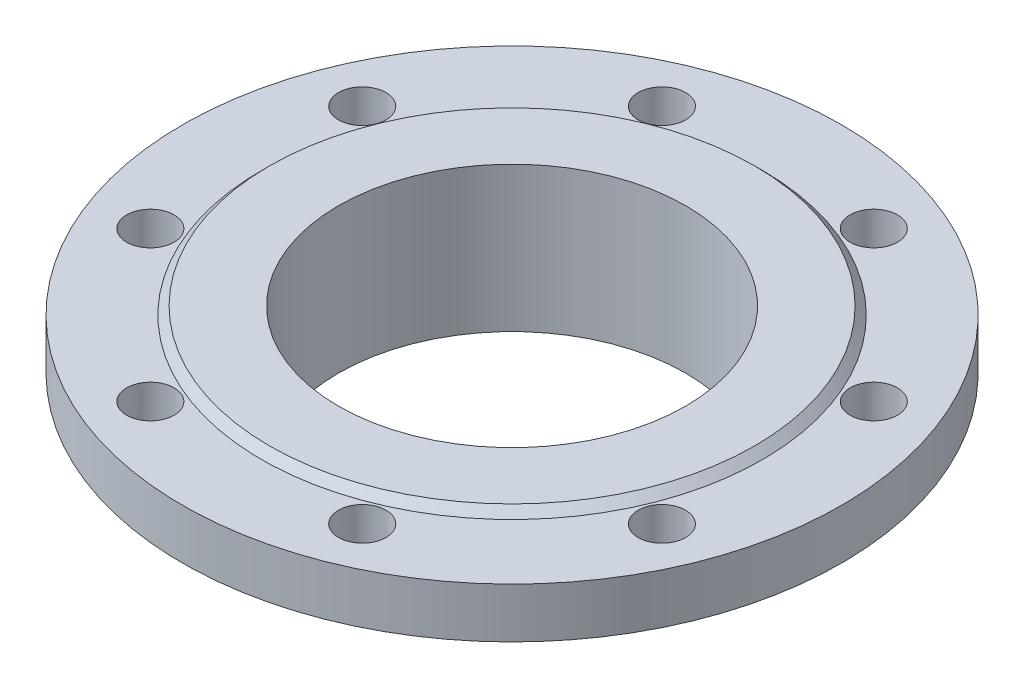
from build123d import *

# Parameters (mm, degrees)
ESQUISSE2_R             = 9
ENL_V_MAT_EXTRU_1_DEPTH = 543.175248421


with BuildPart() as part:
    # Esquisse1 → R_volution1 (revolve)
    with BuildSketch(Plane.XY, mode=Mode.PRIVATE) as r_volution1_sk:
        Polygon((-330.15, 375), (-330.15, 387), (-321, 408), (-275, 408), (-275, 427), (-305, 427), (-308, 430), (-334.15, 430), (-334.15, 375), align=None)
    revolve(r_volution1_sk.sketch.rotate(Axis((-400, 375, 0), (0, 1, 0)), 90), axis=Axis((-400, 375, 0), (0, 1, 0)))

    # Esquisse2 → Enl_v. mat.-Extru.1 (cut, through all)
    with BuildSketch(Plane(origin=(0, 427, 0), x_dir=(1, 0, 0), z_dir=(0, 1, 0))):
        with Locations(Location((-302.992649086, 40.181760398, 0), (0, 0, 270))):
            Circle(ESQUISSE2_R)
        with Locations(Location((-302.992649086, -40.181760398, 0), (0, 0, 270))):
            Circle(ESQUISSE2_R)
        with Locations(Location((-359.818239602, -97.007350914, 0), (0, 0, 270))):
            Circle(ESQUISSE2_R)
        with Locations(Location((-440.181760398, -97.007350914, 0), (0, 0, 270))):
            Circle(ESQUISSE2_R)
        with Locations(Location((-497.007350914, -40.181760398, 0), (0, 0, 270))):
            Circle(ESQUISSE2_R)
        with Locations(Location((-497.007350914, 40.181760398, 0), (0, 0, 270))):
            Circle(ESQUISSE2_R)
        with Locations(Location((-440.181760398, 97.007350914, 0), (0, 0, 270))):
            Circle(ESQUISSE2_R)
        with Locations(Location((-359.818239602, 97.007350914, 0), (0, 0, 270))):
            Circle(ESQUISSE2_R)
    extrude(amount=-ENL_V_MAT_EXTRU_1_DEPTH, mode=Mode.SUBTRACT)


solid = part.part
